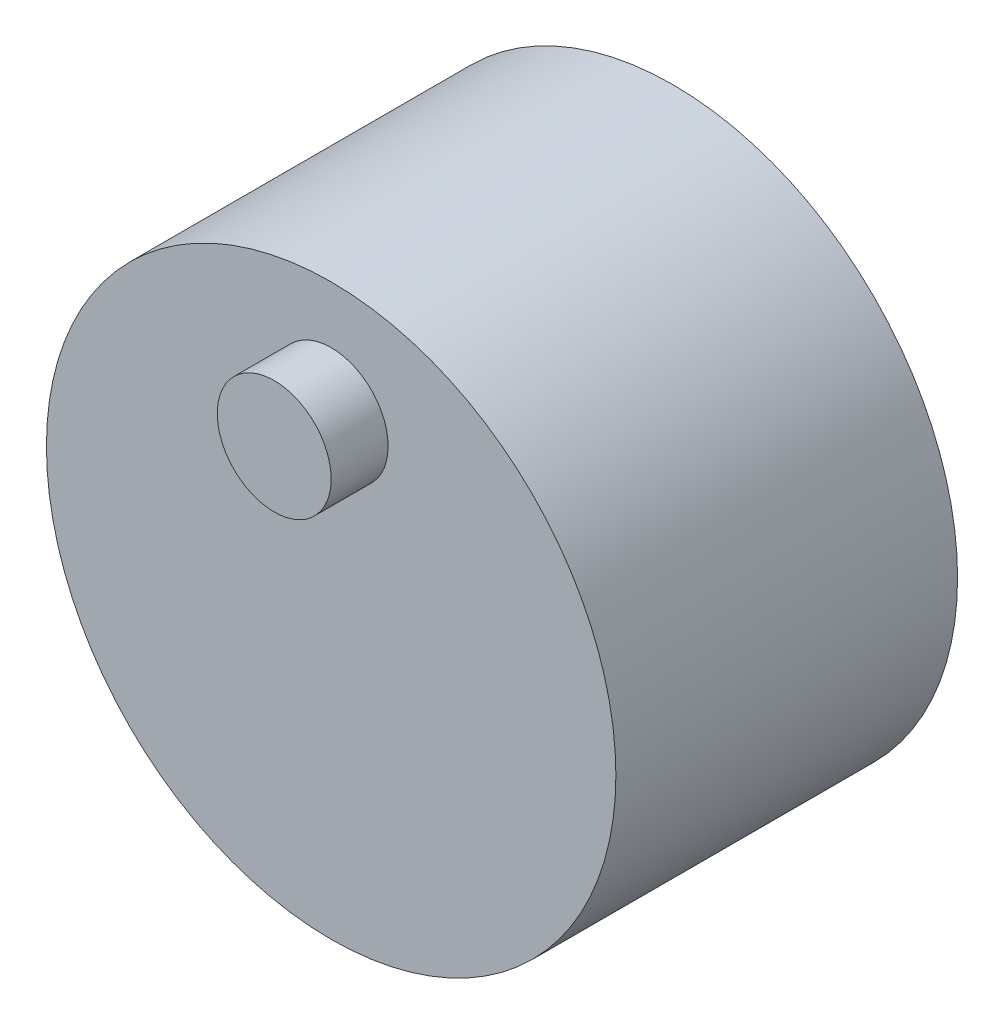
from build123d import *

# Parameters (mm, degrees)
BOSS_EXTRUDE1_DEPTH      = 150
BOSS_EXTRUDE1_DEPTH_BACK = 150
SKETCH1_R                = 250
SKETCH2_R                = 50
BOSS_EXTRUDE2_DEPTH      = 50
SKETCH3_R                = 50
BOSS_EXTRUDE3_DEPTH      = 50


with BuildPart() as part:
    # Sketch1 → Boss-Extrude1 (new, two sides: drawn at the far end of the back side and taken through both)
    with BuildSketch(Plane.XY.offset(-BOSS_EXTRUDE1_DEPTH_BACK)):
        Circle(SKETCH1_R)
    extrude(amount=BOSS_EXTRUDE1_DEPTH + BOSS_EXTRUDE1_DEPTH_BACK)

    # Sketch2 → Boss-Extrude2 (add)
    with BuildSketch(Plane.XY.offset(150)):
        with Locations((0, 150)):
            Circle(SKETCH2_R)
    extrude(amount=BOSS_EXTRUDE2_DEPTH)

    # Sketch3 → Boss-Extrude3 (add)
    with BuildSketch(Plane(origin=(0, 0, -150), x_dir=(-1, 0, 0), z_dir=(0, 0, -1))):
        with Locations(Location((0, -150, 0), (0, 0, 180))):
            Circle(SKETCH3_R)
    extrude(amount=BOSS_EXTRUDE3_DEPTH)


solid = part.part
